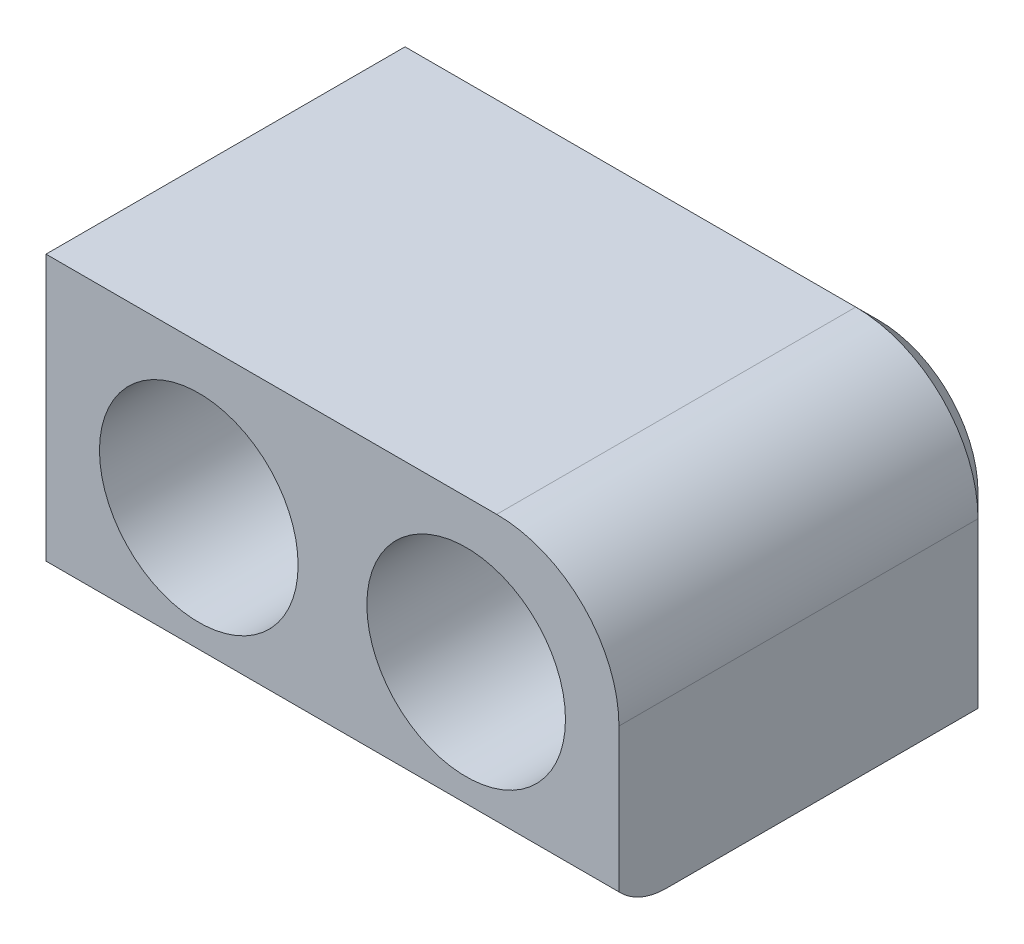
from build123d import *

# Parameters (mm, degrees)
SKETCH3_W             = 19.05
SKETCH3_H             = 9.525
EXTRUDE1_DEPTH        = 12.7
FILLET1_R             = 4.064
F_6_CBORE_D           = 4.318
F_6_CBORE_CBORE_D     = 6.604
F_6_CBORE_CBORE_DEPTH = 4.826
CUT_EXTRUDE1_DEPTH    = 25.797542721
CHAMFER1_SIZE         = 0.762


with BuildPart() as part:
    # Sketch3 → Extrude1 (new body)
    with BuildSketch(Plane.XY):
        with Locations((9.525, 4.7625)):
            Rectangle(SKETCH3_W, SKETCH3_H)
    extrude(amount=-EXTRUDE1_DEPTH)

    # Fillet1
    fillet1_edges = [part.edges().sort_by_distance(p)[0] for p in [
        (19.05, 9.525, -6.35),
    ]]
    fillet(fillet1_edges, radius=FILLET1_R)

    # 6 CBORE (through all)
    with Locations(Plane.XY):
        with Locations((5.08, 4.7625), (13.97, 4.7625)):
            CounterBoreHole(F_6_CBORE_D / 2, F_6_CBORE_CBORE_D / 2, F_6_CBORE_CBORE_DEPTH)

    # Sketch8 → Cut-Extrude1 (cut, through all)
    with BuildSketch(Plane.ZY):
        with BuildLine():
            Line((0, 0.685077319), (1.27, 0.685077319))
            Line((1.27, 0.685077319), (1.27, -1.854922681))
            Line((1.27, -1.854922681), (-1.5748, -1.854922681))
            Line((-1.5748, -1.854922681), (-1.5748, 0))
            ThreePointArc((-1.5748, 0), (-0.716119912, 0.178685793), (0, 0.685077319))
        make_face()
    extrude(amount=-CUT_EXTRUDE1_DEPTH, mode=Mode.SUBTRACT)

    # Chamfer1
    chamfer1_edges = [part.edges().sort_by_distance(p)[0] for p in [
        (19.05, 2.7305, -12.7),
        (7.493, 9.525, -12.7),
        (17.859681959, 8.334681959, -12.7),
    ]]
    chamfer(chamfer1_edges, length=CHAMFER1_SIZE)


solid = part.part
